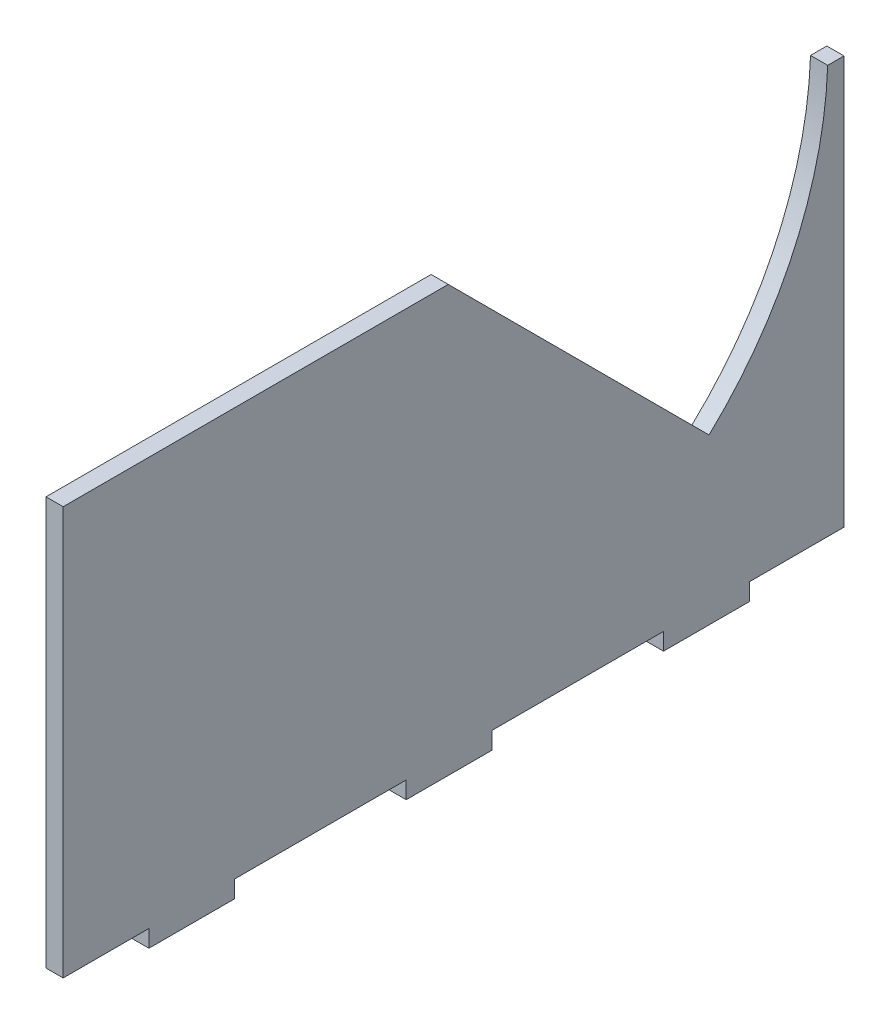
ISO-10303-21;
HEADER;
FILE_DESCRIPTION(('STEP AP214'),'2;1');
FILE_NAME('part.step','',(''),(''),'','','');
FILE_SCHEMA(('AUTOMOTIVE_DESIGN { 1 0 10303 214 1 1 1 1 }'));
ENDSEC;
DATA;
#1=APPLICATION_CONTEXT('core data for automotive mechanical design processes');
#2=APPLICATION_PROTOCOL_DEFINITION('international standard','automotive_design',2000,#1);
#3=PRODUCT_CONTEXT('',#1,'mechanical');
#4=PRODUCT('Part','Part','',(#3));
#5=PRODUCT_RELATED_PRODUCT_CATEGORY('part','',(#4));
#6=PRODUCT_DEFINITION_FORMATION('','',#4);
#7=PRODUCT_DEFINITION_CONTEXT('part definition',#1,'design');
#8=PRODUCT_DEFINITION('design','',#6,#7);
#9=PRODUCT_DEFINITION_SHAPE('','',#8);
#10=(LENGTH_UNIT() NAMED_UNIT(*) SI_UNIT(.MILLI.,.METRE.));
#11=(NAMED_UNIT(*) PLANE_ANGLE_UNIT() SI_UNIT($,.RADIAN.));
#12=(NAMED_UNIT(*) SI_UNIT($,.STERADIAN.) SOLID_ANGLE_UNIT());
#13=UNCERTAINTY_MEASURE_WITH_UNIT(LENGTH_MEASURE(1.E-05),#10,'distance_accuracy_value','');
#14=(GEOMETRIC_REPRESENTATION_CONTEXT(3) GLOBAL_UNCERTAINTY_ASSIGNED_CONTEXT((#13)) GLOBAL_UNIT_ASSIGNED_CONTEXT((#10,
#11,#12)) REPRESENTATION_CONTEXT('',''));
#15=CARTESIAN_POINT('',(0.,0.,0.));
#16=DIRECTION('',(0.,0.,1.));
#17=DIRECTION('',(1.,0.,0.));
#18=AXIS2_PLACEMENT_3D('',#15,#16,#17);
#19=CARTESIAN_POINT('',(20.,475.917508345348,0.));
#20=DIRECTION('',(0.,0.,-1.));
#21=DIRECTION('',(0.,1.,0.));
#22=AXIS2_PLACEMENT_3D('',#19,#20,#21);
#23=PLANE('',#22);
#24=DIRECTION('',(0.,-1.,0.));
#25=VECTOR('',#24,1.);
#26=CARTESIAN_POINT('',(0.,475.917508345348,0.));
#27=LINE('',#26,#25);
#28=CARTESIAN_POINT('',(0.,475.917508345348,0.));
#29=VERTEX_POINT('',#28);
#30=CARTESIAN_POINT('',(0.,0.,0.));
#31=VERTEX_POINT('',#30);
#32=EDGE_CURVE('E194',#29,#31,#27,.T.);
#33=ORIENTED_EDGE('',*,*,#32,.T.);
#34=DIRECTION('',(-1.,0.,0.));
#35=VECTOR('',#34,1.);
#36=CARTESIAN_POINT('',(20.,0.,0.));
#37=LINE('',#36,#35);
#38=CARTESIAN_POINT('',(20.,0.,0.));
#39=VERTEX_POINT('',#38);
#40=EDGE_CURVE('E11',#39,#31,#37,.T.);
#41=ORIENTED_EDGE('',*,*,#40,.F.);
#42=DIRECTION('',(0.,-1.,0.));
#43=VECTOR('',#42,1.);
#44=CARTESIAN_POINT('',(20.,475.917508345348,0.));
#45=LINE('',#44,#43);
#46=CARTESIAN_POINT('',(20.,475.917508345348,0.));
#47=VERTEX_POINT('',#46);
#48=EDGE_CURVE('E230',#47,#39,#45,.T.);
#49=ORIENTED_EDGE('',*,*,#48,.F.);
#50=DIRECTION('',(-1.,0.,0.));
#51=VECTOR('',#50,1.);
#52=CARTESIAN_POINT('',(20.,475.917508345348,0.));
#53=LINE('',#52,#51);
#54=EDGE_CURVE('E190',#47,#29,#53,.T.);
#55=ORIENTED_EDGE('',*,*,#54,.T.);
#56=EDGE_LOOP('',(#33,#41,#49,#55));
#57=FACE_BOUND('',#56,.T.);
#58=ADVANCED_FACE('F32',(#57),#23,.F.);
#59=CARTESIAN_POINT('',(20.,0.,0.));
#60=DIRECTION('',(0.,1.,0.));
#61=DIRECTION('',(0.,0.,1.));
#62=AXIS2_PLACEMENT_3D('',#59,#60,#61);
#63=PLANE('',#62);
#64=DIRECTION('',(0.,0.,-1.));
#65=VECTOR('',#64,1.);
#66=CARTESIAN_POINT('',(0.,0.,0.));
#67=LINE('',#66,#65);
#68=CARTESIAN_POINT('',(0.,0.,-100.));
#69=VERTEX_POINT('',#68);
#70=EDGE_CURVE('E197',#31,#69,#67,.T.);
#71=ORIENTED_EDGE('',*,*,#70,.T.);
#72=DIRECTION('',(-1.,0.,0.));
#73=VECTOR('',#72,1.);
#74=CARTESIAN_POINT('',(20.,0.,-100.));
#75=LINE('',#74,#73);
#76=CARTESIAN_POINT('',(20.,0.,-100.));
#77=VERTEX_POINT('',#76);
#78=EDGE_CURVE('E40',#77,#69,#75,.T.);
#79=ORIENTED_EDGE('',*,*,#78,.F.);
#80=DIRECTION('',(0.,0.,-1.));
#81=VECTOR('',#80,1.);
#82=CARTESIAN_POINT('',(20.,0.,0.));
#83=LINE('',#82,#81);
#84=EDGE_CURVE('E124',#39,#77,#83,.T.);
#85=ORIENTED_EDGE('',*,*,#84,.F.);
#86=ORIENTED_EDGE('',*,*,#40,.T.);
#87=EDGE_LOOP('',(#71,#79,#85,#86));
#88=FACE_BOUND('',#87,.T.);
#89=ADVANCED_FACE('F343',(#88),#63,.F.);
#90=CARTESIAN_POINT('',(20.,0.,-100.));
#91=DIRECTION('',(0.,0.,-1.));
#92=DIRECTION('',(-1.,0.,0.));
#93=AXIS2_PLACEMENT_3D('',#90,#91,#92);
#94=PLANE('',#93);
#95=DIRECTION('',(0.,-1.,0.));
#96=VECTOR('',#95,1.);
#97=CARTESIAN_POINT('',(0.,0.,-100.));
#98=LINE('',#97,#96);
#99=CARTESIAN_POINT('',(0.,-20.,-100.));
#100=VERTEX_POINT('',#99);
#101=EDGE_CURVE('E199',#69,#100,#98,.T.);
#102=ORIENTED_EDGE('',*,*,#101,.T.);
#103=DIRECTION('',(-1.,0.,0.));
#104=VECTOR('',#103,1.);
#105=CARTESIAN_POINT('',(20.,-20.,-100.));
#106=LINE('',#105,#104);
#107=CARTESIAN_POINT('',(20.,-20.,-100.));
#108=VERTEX_POINT('',#107);
#109=EDGE_CURVE('E270',#108,#100,#106,.T.);
#110=ORIENTED_EDGE('',*,*,#109,.F.);
#111=DIRECTION('',(0.,-1.,0.));
#112=VECTOR('',#111,1.);
#113=CARTESIAN_POINT('',(20.,0.,-100.));
#114=LINE('',#113,#112);
#115=EDGE_CURVE('E278',#77,#108,#114,.T.);
#116=ORIENTED_EDGE('',*,*,#115,.F.);
#117=ORIENTED_EDGE('',*,*,#78,.T.);
#118=EDGE_LOOP('',(#102,#110,#116,#117));
#119=FACE_BOUND('',#118,.T.);
#120=ADVANCED_FACE('F276',(#119),#94,.F.);
#121=CARTESIAN_POINT('',(20.,-20.,-100.));
#122=DIRECTION('',(0.,1.,0.));
#123=DIRECTION('',(0.,0.,1.));
#124=AXIS2_PLACEMENT_3D('',#121,#122,#123);
#125=PLANE('',#124);
#126=DIRECTION('',(0.,0.,-1.));
#127=VECTOR('',#126,1.);
#128=CARTESIAN_POINT('',(0.,-20.,-100.));
#129=LINE('',#128,#127);
#130=CARTESIAN_POINT('',(0.,-20.,-200.));
#131=VERTEX_POINT('',#130);
#132=EDGE_CURVE('E201',#100,#131,#129,.T.);
#133=ORIENTED_EDGE('',*,*,#132,.T.);
#134=DIRECTION('',(-1.,0.,0.));
#135=VECTOR('',#134,1.);
#136=CARTESIAN_POINT('',(20.,-20.,-200.));
#137=LINE('',#136,#135);
#138=CARTESIAN_POINT('',(20.,-20.,-200.));
#139=VERTEX_POINT('',#138);
#140=EDGE_CURVE('E267',#139,#131,#137,.T.);
#141=ORIENTED_EDGE('',*,*,#140,.F.);
#142=DIRECTION('',(0.,0.,-1.));
#143=VECTOR('',#142,1.);
#144=CARTESIAN_POINT('',(20.,-20.,-100.));
#145=LINE('',#144,#143);
#146=EDGE_CURVE('E296',#108,#139,#145,.T.);
#147=ORIENTED_EDGE('',*,*,#146,.F.);
#148=ORIENTED_EDGE('',*,*,#109,.T.);
#149=EDGE_LOOP('',(#133,#141,#147,#148));
#150=FACE_BOUND('',#149,.T.);
#151=ADVANCED_FACE('F287',(#150),#125,.F.);
#152=CARTESIAN_POINT('',(20.,-20.,-200.));
#153=DIRECTION('',(0.,0.,1.));
#154=DIRECTION('',(1.,0.,0.));
#155=AXIS2_PLACEMENT_3D('',#152,#153,#154);
#156=PLANE('',#155);
#157=DIRECTION('',(0.,1.,0.));
#158=VECTOR('',#157,1.);
#159=CARTESIAN_POINT('',(0.,-20.,-200.));
#160=LINE('',#159,#158);
#161=CARTESIAN_POINT('',(0.,0.,-200.));
#162=VERTEX_POINT('',#161);
#163=EDGE_CURVE('E203',#131,#162,#160,.T.);
#164=ORIENTED_EDGE('',*,*,#163,.T.);
#165=DIRECTION('',(-1.,0.,0.));
#166=VECTOR('',#165,1.);
#167=CARTESIAN_POINT('',(20.,0.,-200.));
#168=LINE('',#167,#166);
#169=CARTESIAN_POINT('',(20.,0.,-200.));
#170=VERTEX_POINT('',#169);
#171=EDGE_CURVE('E264',#170,#162,#168,.T.);
#172=ORIENTED_EDGE('',*,*,#171,.F.);
#173=DIRECTION('',(0.,1.,0.));
#174=VECTOR('',#173,1.);
#175=CARTESIAN_POINT('',(20.,-20.,-200.));
#176=LINE('',#175,#174);
#177=EDGE_CURVE('E293',#139,#170,#176,.T.);
#178=ORIENTED_EDGE('',*,*,#177,.F.);
#179=ORIENTED_EDGE('',*,*,#140,.T.);
#180=EDGE_LOOP('',(#164,#172,#178,#179));
#181=FACE_BOUND('',#180,.T.);
#182=ADVANCED_FACE('F291',(#181),#156,.F.);
#183=CARTESIAN_POINT('',(20.,0.,-200.));
#184=DIRECTION('',(0.,1.,0.));
#185=DIRECTION('',(0.,0.,1.));
#186=AXIS2_PLACEMENT_3D('',#183,#184,#185);
#187=PLANE('',#186);
#188=DIRECTION('',(0.,0.,-1.));
#189=VECTOR('',#188,1.);
#190=CARTESIAN_POINT('',(0.,0.,-200.));
#191=LINE('',#190,#189);
#192=CARTESIAN_POINT('',(0.,0.,-400.));
#193=VERTEX_POINT('',#192);
#194=EDGE_CURVE('E205',#162,#193,#191,.T.);
#195=ORIENTED_EDGE('',*,*,#194,.T.);
#196=DIRECTION('',(-1.,0.,0.));
#197=VECTOR('',#196,1.);
#198=CARTESIAN_POINT('',(20.,0.,-400.));
#199=LINE('',#198,#197);
#200=CARTESIAN_POINT('',(20.,0.,-400.));
#201=VERTEX_POINT('',#200);
#202=EDGE_CURVE('E261',#201,#193,#199,.T.);
#203=ORIENTED_EDGE('',*,*,#202,.F.);
#204=DIRECTION('',(0.,0.,-1.));
#205=VECTOR('',#204,1.);
#206=CARTESIAN_POINT('',(20.,0.,-200.));
#207=LINE('',#206,#205);
#208=EDGE_CURVE('E295',#170,#201,#207,.T.);
#209=ORIENTED_EDGE('',*,*,#208,.F.);
#210=ORIENTED_EDGE('',*,*,#171,.T.);
#211=EDGE_LOOP('',(#195,#203,#209,#210));
#212=FACE_BOUND('',#211,.T.);
#213=ADVANCED_FACE('F356',(#212),#187,.F.);
#214=CARTESIAN_POINT('',(20.,0.,-400.));
#215=DIRECTION('',(0.,0.,-1.));
#216=DIRECTION('',(-1.,0.,0.));
#217=AXIS2_PLACEMENT_3D('',#214,#215,#216);
#218=PLANE('',#217);
#219=DIRECTION('',(0.,-1.,0.));
#220=VECTOR('',#219,1.);
#221=CARTESIAN_POINT('',(0.,0.,-400.));
#222=LINE('',#221,#220);
#223=CARTESIAN_POINT('',(0.,-20.,-400.));
#224=VERTEX_POINT('',#223);
#225=EDGE_CURVE('E207',#193,#224,#222,.T.);
#226=ORIENTED_EDGE('',*,*,#225,.T.);
#227=DIRECTION('',(-1.,0.,0.));
#228=VECTOR('',#227,1.);
#229=CARTESIAN_POINT('',(20.,-20.,-400.));
#230=LINE('',#229,#228);
#231=CARTESIAN_POINT('',(20.,-20.,-400.));
#232=VERTEX_POINT('',#231);
#233=EDGE_CURVE('E258',#232,#224,#230,.T.);
#234=ORIENTED_EDGE('',*,*,#233,.F.);
#235=DIRECTION('',(0.,-1.,0.));
#236=VECTOR('',#235,1.);
#237=CARTESIAN_POINT('',(20.,0.,-400.));
#238=LINE('',#237,#236);
#239=EDGE_CURVE('E298',#201,#232,#238,.T.);
#240=ORIENTED_EDGE('',*,*,#239,.F.);
#241=ORIENTED_EDGE('',*,*,#202,.T.);
#242=EDGE_LOOP('',(#226,#234,#240,#241));
#243=FACE_BOUND('',#242,.T.);
#244=ADVANCED_FACE('F359',(#243),#218,.F.);
#245=CARTESIAN_POINT('',(20.,-20.,-400.));
#246=DIRECTION('',(0.,1.,0.));
#247=DIRECTION('',(0.,0.,1.));
#248=AXIS2_PLACEMENT_3D('',#245,#246,#247);
#249=PLANE('',#248);
#250=DIRECTION('',(0.,0.,-1.));
#251=VECTOR('',#250,1.);
#252=CARTESIAN_POINT('',(0.,-20.,-400.));
#253=LINE('',#252,#251);
#254=CARTESIAN_POINT('',(0.,-20.,-500.));
#255=VERTEX_POINT('',#254);
#256=EDGE_CURVE('E209',#224,#255,#253,.T.);
#257=ORIENTED_EDGE('',*,*,#256,.T.);
#258=DIRECTION('',(-1.,0.,0.));
#259=VECTOR('',#258,1.);
#260=CARTESIAN_POINT('',(20.,-20.,-500.));
#261=LINE('',#260,#259);
#262=CARTESIAN_POINT('',(20.,-20.,-500.));
#263=VERTEX_POINT('',#262);
#264=EDGE_CURVE('E255',#263,#255,#261,.T.);
#265=ORIENTED_EDGE('',*,*,#264,.F.);
#266=DIRECTION('',(0.,0.,-1.));
#267=VECTOR('',#266,1.);
#268=CARTESIAN_POINT('',(20.,-20.,-400.));
#269=LINE('',#268,#267);
#270=EDGE_CURVE('E304',#232,#263,#269,.T.);
#271=ORIENTED_EDGE('',*,*,#270,.F.);
#272=ORIENTED_EDGE('',*,*,#233,.T.);
#273=EDGE_LOOP('',(#257,#265,#271,#272));
#274=FACE_BOUND('',#273,.T.);
#275=ADVANCED_FACE('F363',(#274),#249,.F.);
#276=CARTESIAN_POINT('',(20.,-20.,-500.));
#277=DIRECTION('',(0.,0.,1.));
#278=DIRECTION('',(1.,0.,0.));
#279=AXIS2_PLACEMENT_3D('',#276,#277,#278);
#280=PLANE('',#279);
#281=DIRECTION('',(0.,1.,0.));
#282=VECTOR('',#281,1.);
#283=CARTESIAN_POINT('',(0.,-20.,-500.));
#284=LINE('',#283,#282);
#285=CARTESIAN_POINT('',(0.,0.,-500.));
#286=VERTEX_POINT('',#285);
#287=EDGE_CURVE('E211',#255,#286,#284,.T.);
#288=ORIENTED_EDGE('',*,*,#287,.T.);
#289=DIRECTION('',(-1.,0.,0.));
#290=VECTOR('',#289,1.);
#291=CARTESIAN_POINT('',(20.,0.,-500.));
#292=LINE('',#291,#290);
#293=CARTESIAN_POINT('',(20.,0.,-500.));
#294=VERTEX_POINT('',#293);
#295=EDGE_CURVE('E252',#294,#286,#292,.T.);
#296=ORIENTED_EDGE('',*,*,#295,.F.);
#297=DIRECTION('',(0.,1.,0.));
#298=VECTOR('',#297,1.);
#299=CARTESIAN_POINT('',(20.,-20.,-500.));
#300=LINE('',#299,#298);
#301=EDGE_CURVE('E306',#263,#294,#300,.T.);
#302=ORIENTED_EDGE('',*,*,#301,.F.);
#303=ORIENTED_EDGE('',*,*,#264,.T.);
#304=EDGE_LOOP('',(#288,#296,#302,#303));
#305=FACE_BOUND('',#304,.T.);
#306=ADVANCED_FACE('F367',(#305),#280,.F.);
#307=CARTESIAN_POINT('',(20.,0.,-500.));
#308=DIRECTION('',(0.,1.,0.));
#309=DIRECTION('',(0.,0.,1.));
#310=AXIS2_PLACEMENT_3D('',#307,#308,#309);
#311=PLANE('',#310);
#312=DIRECTION('',(0.,0.,-1.));
#313=VECTOR('',#312,1.);
#314=CARTESIAN_POINT('',(0.,0.,-500.));
#315=LINE('',#314,#313);
#316=CARTESIAN_POINT('',(0.,0.,-700.));
#317=VERTEX_POINT('',#316);
#318=EDGE_CURVE('E213',#286,#317,#315,.T.);
#319=ORIENTED_EDGE('',*,*,#318,.T.);
#320=DIRECTION('',(-1.,0.,0.));
#321=VECTOR('',#320,1.);
#322=CARTESIAN_POINT('',(20.,0.,-700.));
#323=LINE('',#322,#321);
#324=CARTESIAN_POINT('',(20.,0.,-700.));
#325=VERTEX_POINT('',#324);
#326=EDGE_CURVE('E249',#325,#317,#323,.T.);
#327=ORIENTED_EDGE('',*,*,#326,.F.);
#328=DIRECTION('',(0.,0.,-1.));
#329=VECTOR('',#328,1.);
#330=CARTESIAN_POINT('',(20.,0.,-500.));
#331=LINE('',#330,#329);
#332=EDGE_CURVE('E308',#294,#325,#331,.T.);
#333=ORIENTED_EDGE('',*,*,#332,.F.);
#334=ORIENTED_EDGE('',*,*,#295,.T.);
#335=EDGE_LOOP('',(#319,#327,#333,#334));
#336=FACE_BOUND('',#335,.T.);
#337=ADVANCED_FACE('F371',(#336),#311,.F.);
#338=CARTESIAN_POINT('',(20.,0.,-700.));
#339=DIRECTION('',(0.,0.,-1.));
#340=DIRECTION('',(-1.,0.,0.));
#341=AXIS2_PLACEMENT_3D('',#338,#339,#340);
#342=PLANE('',#341);
#343=DIRECTION('',(0.,-1.,0.));
#344=VECTOR('',#343,1.);
#345=CARTESIAN_POINT('',(0.,0.,-700.));
#346=LINE('',#345,#344);
#347=CARTESIAN_POINT('',(0.,-20.,-700.));
#348=VERTEX_POINT('',#347);
#349=EDGE_CURVE('E215',#317,#348,#346,.T.);
#350=ORIENTED_EDGE('',*,*,#349,.T.);
#351=DIRECTION('',(-1.,0.,0.));
#352=VECTOR('',#351,1.);
#353=CARTESIAN_POINT('',(20.,-20.,-700.));
#354=LINE('',#353,#352);
#355=CARTESIAN_POINT('',(20.,-20.,-700.));
#356=VERTEX_POINT('',#355);
#357=EDGE_CURVE('E246',#356,#348,#354,.T.);
#358=ORIENTED_EDGE('',*,*,#357,.F.);
#359=DIRECTION('',(0.,-1.,0.));
#360=VECTOR('',#359,1.);
#361=CARTESIAN_POINT('',(20.,0.,-700.));
#362=LINE('',#361,#360);
#363=EDGE_CURVE('E310',#325,#356,#362,.T.);
#364=ORIENTED_EDGE('',*,*,#363,.F.);
#365=ORIENTED_EDGE('',*,*,#326,.T.);
#366=EDGE_LOOP('',(#350,#358,#364,#365));
#367=FACE_BOUND('',#366,.T.);
#368=ADVANCED_FACE('F375',(#367),#342,.F.);
#369=CARTESIAN_POINT('',(20.,-20.,-700.));
#370=DIRECTION('',(0.,1.,0.));
#371=DIRECTION('',(0.,0.,1.));
#372=AXIS2_PLACEMENT_3D('',#369,#370,#371);
#373=PLANE('',#372);
#374=DIRECTION('',(0.,0.,-1.));
#375=VECTOR('',#374,1.);
#376=CARTESIAN_POINT('',(0.,-20.,-700.));
#377=LINE('',#376,#375);
#378=CARTESIAN_POINT('',(0.,-20.,-800.));
#379=VERTEX_POINT('',#378);
#380=EDGE_CURVE('E217',#348,#379,#377,.T.);
#381=ORIENTED_EDGE('',*,*,#380,.T.);
#382=DIRECTION('',(-1.,0.,0.));
#383=VECTOR('',#382,1.);
#384=CARTESIAN_POINT('',(20.,-20.,-800.));
#385=LINE('',#384,#383);
#386=CARTESIAN_POINT('',(20.,-20.,-800.));
#387=VERTEX_POINT('',#386);
#388=EDGE_CURVE('E243',#387,#379,#385,.T.);
#389=ORIENTED_EDGE('',*,*,#388,.F.);
#390=DIRECTION('',(0.,0.,-1.));
#391=VECTOR('',#390,1.);
#392=CARTESIAN_POINT('',(20.,-20.,-700.));
#393=LINE('',#392,#391);
#394=EDGE_CURVE('E312',#356,#387,#393,.T.);
#395=ORIENTED_EDGE('',*,*,#394,.F.);
#396=ORIENTED_EDGE('',*,*,#357,.T.);
#397=EDGE_LOOP('',(#381,#389,#395,#396));
#398=FACE_BOUND('',#397,.T.);
#399=ADVANCED_FACE('F379',(#398),#373,.F.);
#400=CARTESIAN_POINT('',(20.,-20.,-800.));
#401=DIRECTION('',(0.,0.,1.));
#402=DIRECTION('',(1.,0.,0.));
#403=AXIS2_PLACEMENT_3D('',#400,#401,#402);
#404=PLANE('',#403);
#405=DIRECTION('',(0.,1.,0.));
#406=VECTOR('',#405,1.);
#407=CARTESIAN_POINT('',(0.,-20.,-800.));
#408=LINE('',#407,#406);
#409=CARTESIAN_POINT('',(0.,0.,-800.));
#410=VERTEX_POINT('',#409);
#411=EDGE_CURVE('E219',#379,#410,#408,.T.);
#412=ORIENTED_EDGE('',*,*,#411,.T.);
#413=DIRECTION('',(-1.,0.,0.));
#414=VECTOR('',#413,1.);
#415=CARTESIAN_POINT('',(20.,0.,-800.));
#416=LINE('',#415,#414);
#417=CARTESIAN_POINT('',(20.,0.,-800.));
#418=VERTEX_POINT('',#417);
#419=EDGE_CURVE('E240',#418,#410,#416,.T.);
#420=ORIENTED_EDGE('',*,*,#419,.F.);
#421=DIRECTION('',(0.,1.,0.));
#422=VECTOR('',#421,1.);
#423=CARTESIAN_POINT('',(20.,-20.,-800.));
#424=LINE('',#423,#422);
#425=EDGE_CURVE('E314',#387,#418,#424,.T.);
#426=ORIENTED_EDGE('',*,*,#425,.F.);
#427=ORIENTED_EDGE('',*,*,#388,.T.);
#428=EDGE_LOOP('',(#412,#420,#426,#427));
#429=FACE_BOUND('',#428,.T.);
#430=ADVANCED_FACE('F383',(#429),#404,.F.);
#431=CARTESIAN_POINT('',(20.,0.,-800.));
#432=DIRECTION('',(0.,1.,0.));
#433=DIRECTION('',(0.,0.,1.));
#434=AXIS2_PLACEMENT_3D('',#431,#432,#433);
#435=PLANE('',#434);
#436=DIRECTION('',(0.,0.,-1.));
#437=VECTOR('',#436,1.);
#438=CARTESIAN_POINT('',(0.,0.,-800.));
#439=LINE('',#438,#437);
#440=CARTESIAN_POINT('',(0.,-4.44089209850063E-13,-910.465393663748));
#441=VERTEX_POINT('',#440);
#442=EDGE_CURVE('E221',#410,#441,#439,.T.);
#443=ORIENTED_EDGE('',*,*,#442,.T.);
#444=DIRECTION('',(-1.,0.,0.));
#445=VECTOR('',#444,1.);
#446=CARTESIAN_POINT('',(20.,-4.44089209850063E-13,-910.465393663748));
#447=LINE('',#446,#445);
#448=CARTESIAN_POINT('',(20.,-4.44089209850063E-13,-910.465393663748));
#449=VERTEX_POINT('',#448);
#450=EDGE_CURVE('E237',#449,#441,#447,.T.);
#451=ORIENTED_EDGE('',*,*,#450,.F.);
#452=DIRECTION('',(0.,0.,-1.));
#453=VECTOR('',#452,1.);
#454=CARTESIAN_POINT('',(20.,0.,-800.));
#455=LINE('',#454,#453);
#456=EDGE_CURVE('E316',#418,#449,#455,.T.);
#457=ORIENTED_EDGE('',*,*,#456,.F.);
#458=ORIENTED_EDGE('',*,*,#419,.T.);
#459=EDGE_LOOP('',(#443,#451,#457,#458));
#460=FACE_BOUND('',#459,.T.);
#461=ADVANCED_FACE('F387',(#460),#435,.F.);
#462=CARTESIAN_POINT('',(20.,475.917508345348,-910.465393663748));
#463=DIRECTION('',(0.,0.,1.));
#464=DIRECTION('',(1.,0.,0.));
#465=AXIS2_PLACEMENT_3D('',#462,#463,#464);
#466=PLANE('',#465);
#467=DIRECTION('',(0.,1.,0.));
#468=VECTOR('',#467,1.);
#469=CARTESIAN_POINT('',(0.,475.917508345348,-910.465393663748));
#470=LINE('',#469,#468);
#471=CARTESIAN_POINT('',(0.,475.917508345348,-910.465393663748));
#472=VERTEX_POINT('',#471);
#473=EDGE_CURVE('E223',#441,#472,#470,.T.);
#474=ORIENTED_EDGE('',*,*,#473,.T.);
#475=DIRECTION('',(-1.,0.,0.));
#476=VECTOR('',#475,1.);
#477=CARTESIAN_POINT('',(20.,475.917508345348,-910.465393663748));
#478=LINE('',#477,#476);
#479=CARTESIAN_POINT('',(20.,475.917508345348,-910.465393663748));
#480=VERTEX_POINT('',#479);
#481=EDGE_CURVE('E234',#480,#472,#478,.T.);
#482=ORIENTED_EDGE('',*,*,#481,.F.);
#483=DIRECTION('',(0.,1.,0.));
#484=VECTOR('',#483,1.);
#485=CARTESIAN_POINT('',(20.,475.917508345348,-910.465393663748));
#486=LINE('',#485,#484);
#487=EDGE_CURVE('E318',#449,#480,#486,.T.);
#488=ORIENTED_EDGE('',*,*,#487,.F.);
#489=ORIENTED_EDGE('',*,*,#450,.T.);
#490=EDGE_LOOP('',(#474,#482,#488,#489));
#491=FACE_BOUND('',#490,.T.);
#492=ADVANCED_FACE('F324',(#491),#466,.F.);
#493=CARTESIAN_POINT('',(20.,475.917508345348,-891.465393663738));
#494=DIRECTION('',(0.,-1.,0.));
#495=DIRECTION('',(0.,0.,-1.));
#496=AXIS2_PLACEMENT_3D('',#493,#494,#495);
#497=PLANE('',#496);
#498=DIRECTION('',(0.,0.,1.));
#499=VECTOR('',#498,1.);
#500=CARTESIAN_POINT('',(0.,475.917508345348,-891.465393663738));
#501=LINE('',#500,#499);
#502=CARTESIAN_POINT('',(0.,475.917508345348,-891.465393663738));
#503=VERTEX_POINT('',#502);
#504=EDGE_CURVE('E225',#472,#503,#501,.T.);
#505=ORIENTED_EDGE('',*,*,#504,.T.);
#506=DIRECTION('',(-1.,0.,0.));
#507=VECTOR('',#506,1.);
#508=CARTESIAN_POINT('',(20.,475.917508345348,-891.465393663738));
#509=LINE('',#508,#507);
#510=CARTESIAN_POINT('',(20.,475.917508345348,-891.465393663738));
#511=VERTEX_POINT('',#510);
#512=EDGE_CURVE('E185',#511,#503,#509,.T.);
#513=ORIENTED_EDGE('',*,*,#512,.F.);
#514=DIRECTION('',(0.,0.,1.));
#515=VECTOR('',#514,1.);
#516=CARTESIAN_POINT('',(20.,475.917508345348,-891.465393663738));
#517=LINE('',#516,#515);
#518=EDGE_CURVE('E176',#480,#511,#517,.T.);
#519=ORIENTED_EDGE('',*,*,#518,.F.);
#520=ORIENTED_EDGE('',*,*,#481,.T.);
#521=EDGE_LOOP('',(#505,#513,#519,#520));
#522=FACE_BOUND('',#521,.T.);
#523=ADVANCED_FACE('F328',(#522),#497,.F.);
#524=CARTESIAN_POINT('',(20.,490.917508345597,-455.232696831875));
#525=DIRECTION('',(-1.,0.,0.));
#526=DIRECTION('',(0.,0.,1.));
#527=AXIS2_PLACEMENT_3D('',#524,#525,#526);
#528=CYLINDRICAL_SURFACE('',#527,436.490510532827);
#529=CARTESIAN_POINT('',(0.,490.917508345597,-455.232696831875));
#530=DIRECTION('',(-1.,0.,0.));
#531=DIRECTION('',(0.,0.,-1.));
#532=AXIS2_PLACEMENT_3D('',#529,#530,#531);
#533=CIRCLE('',#532,436.490510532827);
#534=CARTESIAN_POINT('',(0.,171.847808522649,-753.089193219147));
#535=VERTEX_POINT('',#534);
#536=EDGE_CURVE('E184',#503,#535,#533,.T.);
#537=ORIENTED_EDGE('',*,*,#536,.T.);
#538=DIRECTION('',(-1.,0.,0.));
#539=VECTOR('',#538,1.);
#540=CARTESIAN_POINT('',(20.,171.847808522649,-753.089193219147));
#541=LINE('',#540,#539);
#542=CARTESIAN_POINT('',(20.,171.847808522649,-753.089193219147));
#543=VERTEX_POINT('',#542);
#544=EDGE_CURVE('E181',#543,#535,#541,.T.);
#545=ORIENTED_EDGE('',*,*,#544,.F.);
#546=CARTESIAN_POINT('',(20.,490.917508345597,-455.232696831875));
#547=DIRECTION('',(-1.,0.,0.));
#548=DIRECTION('',(0.,0.,-1.));
#549=AXIS2_PLACEMENT_3D('',#546,#547,#548);
#550=CIRCLE('',#549,436.490510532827);
#551=EDGE_CURVE('E170',#511,#543,#550,.T.);
#552=ORIENTED_EDGE('',*,*,#551,.F.);
#553=ORIENTED_EDGE('',*,*,#512,.T.);
#554=EDGE_LOOP('',(#537,#545,#552,#553));
#555=FACE_BOUND('',#554,.T.);
#556=ADVANCED_FACE('F182',(#555),#528,.F.);
#557=CARTESIAN_POINT('',(20.,171.847808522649,-753.089193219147));
#558=DIRECTION('',(0.,-0.707106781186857,0.707106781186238));
#559=DIRECTION('',(0.,-0.707106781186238,-0.707106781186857));
#560=AXIS2_PLACEMENT_3D('',#557,#558,#559);
#561=PLANE('',#560);
#562=DIRECTION('',(0.,0.707106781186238,0.707106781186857));
#563=VECTOR('',#562,1.);
#564=CARTESIAN_POINT('',(0.,171.847808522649,-753.089193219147));
#565=LINE('',#564,#563);
#566=CARTESIAN_POINT('',(0.,475.917508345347,-449.019493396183));
#567=VERTEX_POINT('',#566);
#568=EDGE_CURVE('E110',#535,#567,#565,.T.);
#569=ORIENTED_EDGE('',*,*,#568,.T.);
#570=DIRECTION('',(-1.,0.,0.));
#571=VECTOR('',#570,1.);
#572=CARTESIAN_POINT('',(20.,475.917508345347,-449.019493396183));
#573=LINE('',#572,#571);
#574=CARTESIAN_POINT('',(20.,475.917508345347,-449.019493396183));
#575=VERTEX_POINT('',#574);
#576=EDGE_CURVE('E186',#575,#567,#573,.T.);
#577=ORIENTED_EDGE('',*,*,#576,.F.);
#578=DIRECTION('',(0.,0.707106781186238,0.707106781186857));
#579=VECTOR('',#578,1.);
#580=CARTESIAN_POINT('',(20.,171.847808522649,-753.089193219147));
#581=LINE('',#580,#579);
#582=EDGE_CURVE('E174',#543,#575,#581,.T.);
#583=ORIENTED_EDGE('',*,*,#582,.F.);
#584=ORIENTED_EDGE('',*,*,#544,.T.);
#585=EDGE_LOOP('',(#569,#577,#583,#584));
#586=FACE_BOUND('',#585,.T.);
#587=ADVANCED_FACE('F188',(#586),#561,.F.);
#588=CARTESIAN_POINT('',(20.,475.917508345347,-449.019493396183));
#589=DIRECTION('',(0.,-1.,0.));
#590=DIRECTION('',(0.,0.,-1.));
#591=AXIS2_PLACEMENT_3D('',#588,#589,#590);
#592=PLANE('',#591);
#593=DIRECTION('',(0.,0.,1.));
#594=VECTOR('',#593,1.);
#595=CARTESIAN_POINT('',(0.,475.917508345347,-449.019493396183));
#596=LINE('',#595,#594);
#597=EDGE_CURVE('E116',#567,#29,#596,.T.);
#598=ORIENTED_EDGE('',*,*,#597,.T.);
#599=ORIENTED_EDGE('',*,*,#54,.F.);
#600=DIRECTION('',(0.,0.,1.));
#601=VECTOR('',#600,1.);
#602=CARTESIAN_POINT('',(20.,475.917508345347,-449.019493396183));
#603=LINE('',#602,#601);
#604=EDGE_CURVE('E48',#575,#47,#603,.T.);
#605=ORIENTED_EDGE('',*,*,#604,.F.);
#606=ORIENTED_EDGE('',*,*,#576,.T.);
#607=EDGE_LOOP('',(#598,#599,#605,#606));
#608=FACE_BOUND('',#607,.T.);
#609=ADVANCED_FACE('F332',(#608),#592,.F.);
#610=CARTESIAN_POINT('',(20.,490.917508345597,-455.232696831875));
#611=DIRECTION('',(1.,0.,0.));
#612=DIRECTION('',(0.,0.,-1.));
#613=AXIS2_PLACEMENT_3D('',#610,#611,#612);
#614=PLANE('',#613);
#615=ORIENTED_EDGE('',*,*,#48,.T.);
#616=ORIENTED_EDGE('',*,*,#84,.T.);
#617=ORIENTED_EDGE('',*,*,#115,.T.);
#618=ORIENTED_EDGE('',*,*,#146,.T.);
#619=ORIENTED_EDGE('',*,*,#177,.T.);
#620=ORIENTED_EDGE('',*,*,#208,.T.);
#621=ORIENTED_EDGE('',*,*,#239,.T.);
#622=ORIENTED_EDGE('',*,*,#270,.T.);
#623=ORIENTED_EDGE('',*,*,#301,.T.);
#624=ORIENTED_EDGE('',*,*,#332,.T.);
#625=ORIENTED_EDGE('',*,*,#363,.T.);
#626=ORIENTED_EDGE('',*,*,#394,.T.);
#627=ORIENTED_EDGE('',*,*,#425,.T.);
#628=ORIENTED_EDGE('',*,*,#456,.T.);
#629=ORIENTED_EDGE('',*,*,#487,.T.);
#630=ORIENTED_EDGE('',*,*,#518,.T.);
#631=ORIENTED_EDGE('',*,*,#551,.T.);
#632=ORIENTED_EDGE('',*,*,#582,.T.);
#633=ORIENTED_EDGE('',*,*,#604,.T.);
#634=EDGE_LOOP('',(#615,#616,#617,#618,#619,#620,#621,#622,#623,#624,#625,#626,#627,#628,#629,
#630,#631,#632,#633));
#635=FACE_BOUND('',#634,.T.);
#636=ADVANCED_FACE('F172',(#635),#614,.T.);
#637=CARTESIAN_POINT('',(0.,490.917508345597,-455.232696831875));
#638=DIRECTION('',(1.,0.,0.));
#639=DIRECTION('',(0.,0.,-1.));
#640=AXIS2_PLACEMENT_3D('',#637,#638,#639);
#641=PLANE('',#640);
#642=ORIENTED_EDGE('',*,*,#32,.F.);
#643=ORIENTED_EDGE('',*,*,#597,.F.);
#644=ORIENTED_EDGE('',*,*,#568,.F.);
#645=ORIENTED_EDGE('',*,*,#536,.F.);
#646=ORIENTED_EDGE('',*,*,#504,.F.);
#647=ORIENTED_EDGE('',*,*,#473,.F.);
#648=ORIENTED_EDGE('',*,*,#442,.F.);
#649=ORIENTED_EDGE('',*,*,#411,.F.);
#650=ORIENTED_EDGE('',*,*,#380,.F.);
#651=ORIENTED_EDGE('',*,*,#349,.F.);
#652=ORIENTED_EDGE('',*,*,#318,.F.);
#653=ORIENTED_EDGE('',*,*,#287,.F.);
#654=ORIENTED_EDGE('',*,*,#256,.F.);
#655=ORIENTED_EDGE('',*,*,#225,.F.);
#656=ORIENTED_EDGE('',*,*,#194,.F.);
#657=ORIENTED_EDGE('',*,*,#163,.F.);
#658=ORIENTED_EDGE('',*,*,#132,.F.);
#659=ORIENTED_EDGE('',*,*,#101,.F.);
#660=ORIENTED_EDGE('',*,*,#70,.F.);
#661=EDGE_LOOP('',(#642,#643,#644,#645,#646,#647,#648,#649,#650,#651,#652,#653,#654,#655,#656,
#657,#658,#659,#660));
#662=FACE_BOUND('',#661,.T.);
#663=ADVANCED_FACE('F282',(#662),#641,.F.);
#664=CLOSED_SHELL('',(#58,#89,#120,#151,#182,#213,#244,#275,#306,#337,#368,#399,#430,#461,#492,
#523,#556,#587,#609,#636,#663));
#665=MANIFOLD_SOLID_BREP('B2',#664);
#666=ADVANCED_BREP_SHAPE_REPRESENTATION('',(#18,#665),#14);
#667=SHAPE_DEFINITION_REPRESENTATION(#9,#666);
ENDSEC;
END-ISO-10303-21;
